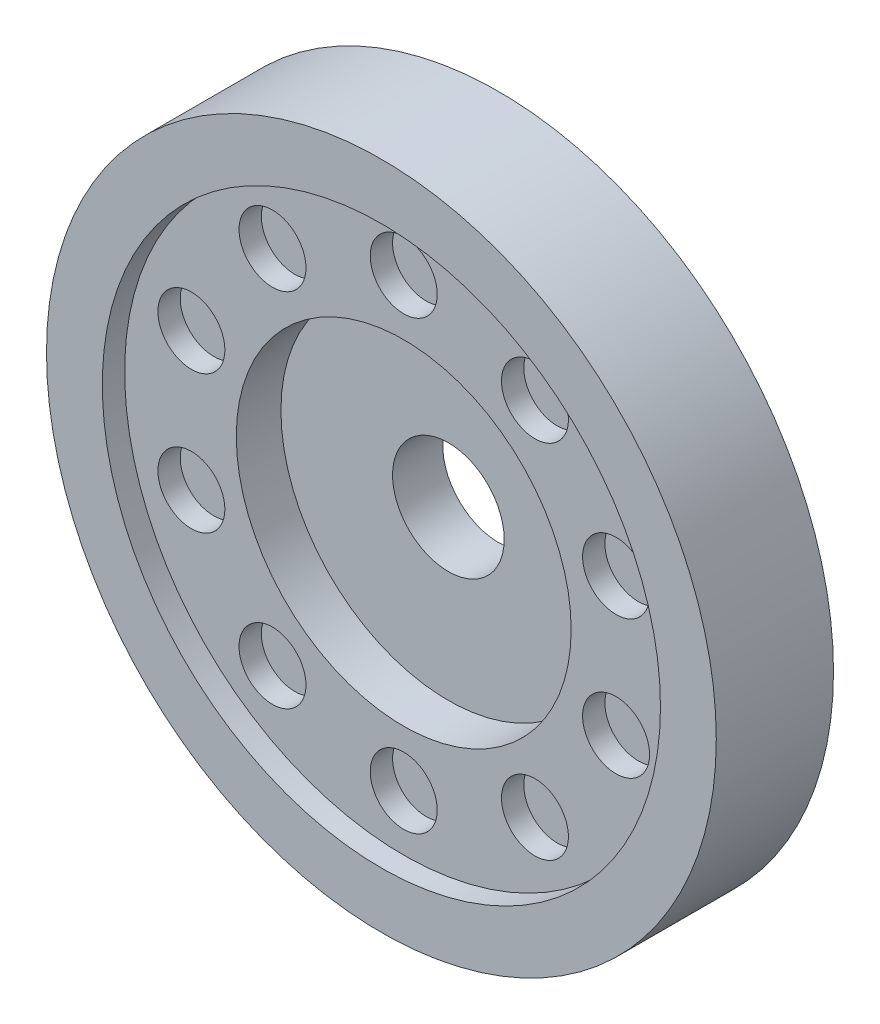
from build123d import *

# Parameters (mm, degrees)
SKETCH1_R           = 381
BOSS_EXTRUDE1_DEPTH = 66.675
SKETCH2_R           = 317.5
CUT_EXTRUDE1_DEPTH  = 25.4
SKETCH3_R           = 38.1
CUT_EXTRUDE2_DEPTH  = 25.4
SKETCH4_R           = 190.5
CUT_EXTRUDE3_DEPTH  = 50.8
SKETCH5_R           = 63.5
CUT_EXTRUDE4_DEPTH  = 545.176846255


with BuildPart() as part:
    # Sketch1 → Boss-Extrude1 (new, symmetric)
    with BuildSketch(Plane.XY):
        Circle(SKETCH1_R)
    extrude(amount=BOSS_EXTRUDE1_DEPTH, both=True)

    # Sketch2 → Cut-Extrude1 (cut)
    with BuildSketch(Plane.XY.offset(66.675)):
        Circle(SKETCH2_R)
    extrude(amount=-CUT_EXTRUDE1_DEPTH, mode=Mode.SUBTRACT)

    # Sketch3 → Cut-Extrude2 (cut)
    with BuildSketch(Plane.XY.offset(41.275)):
        with Locations((0, 254)):
            Circle(SKETCH3_R)
        with Locations((149.297454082, 205.490316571)):
            Circle(SKETCH3_R)
        with Locations((241.568355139, 78.490316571)):
            Circle(SKETCH3_R)
        with Locations((241.568355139, -78.490316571)):
            Circle(SKETCH3_R)
        with Locations((149.297454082, -205.490316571)):
            Circle(SKETCH3_R)
        with Locations((0, -254)):
            Circle(SKETCH3_R)
        with Locations((-149.297454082, -205.490316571)):
            Circle(SKETCH3_R)
        with Locations((-241.568355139, -78.490316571)):
            Circle(SKETCH3_R)
        with Locations((-241.568355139, 78.490316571)):
            Circle(SKETCH3_R)
        with Locations((-149.297454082, 205.490316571)):
            Circle(SKETCH3_R)
    extrude(amount=-CUT_EXTRUDE2_DEPTH, mode=Mode.SUBTRACT)

    # Sketch4 → Cut-Extrude3 (cut)
    with BuildSketch(Plane.XY.offset(41.275)):
        Circle(SKETCH4_R)
    extrude(amount=-CUT_EXTRUDE3_DEPTH, mode=Mode.SUBTRACT)

    # Sketch5 → Cut-Extrude4 (cut, through all)
    with BuildSketch(Plane.XY.offset(-9.525)):
        Circle(SKETCH5_R)
    extrude(amount=-CUT_EXTRUDE4_DEPTH, mode=Mode.SUBTRACT)


solid = part.part
